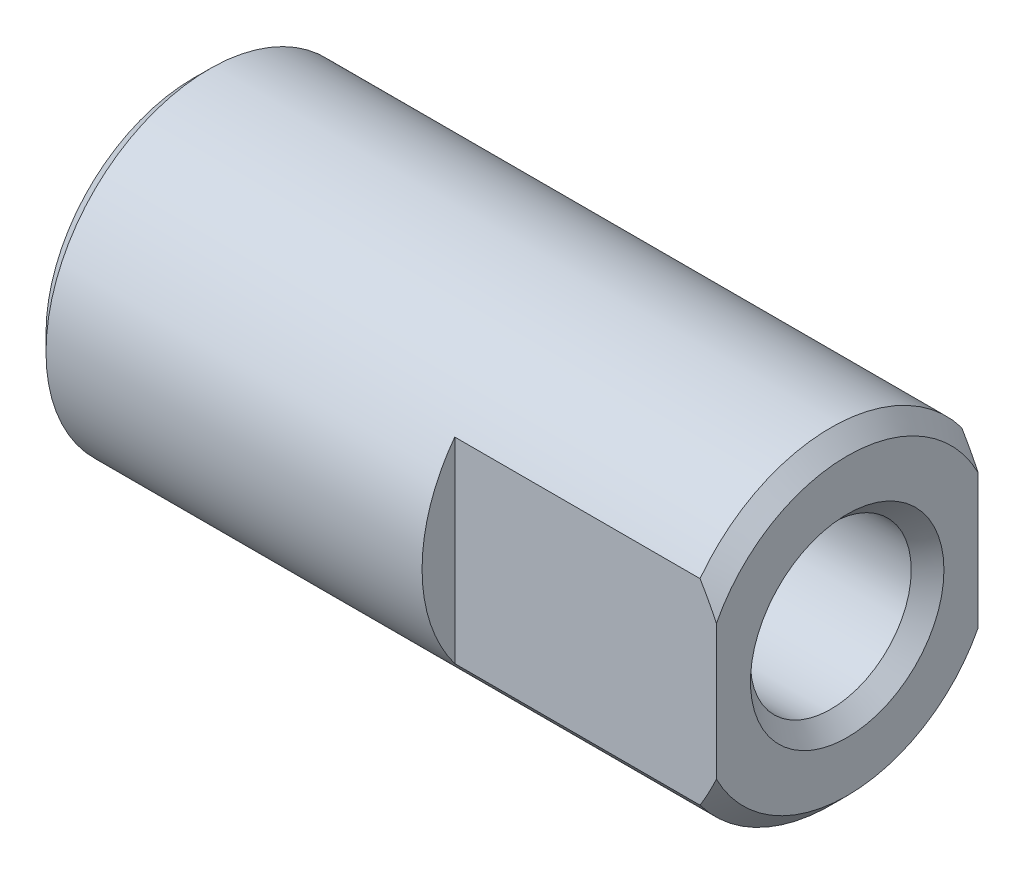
ISO-10303-21;
HEADER;
FILE_DESCRIPTION(('STEP AP214'),'2;1');
FILE_NAME('part.step','',(''),(''),'','','');
FILE_SCHEMA(('AUTOMOTIVE_DESIGN { 1 0 10303 214 1 1 1 1 }'));
ENDSEC;
DATA;
#1=APPLICATION_CONTEXT('core data for automotive mechanical design processes');
#2=APPLICATION_PROTOCOL_DEFINITION('international standard','automotive_design',2000,#1);
#3=PRODUCT_CONTEXT('',#1,'mechanical');
#4=PRODUCT('Part','Part','',(#3));
#5=PRODUCT_RELATED_PRODUCT_CATEGORY('part','',(#4));
#6=PRODUCT_DEFINITION_FORMATION('','',#4);
#7=PRODUCT_DEFINITION_CONTEXT('part definition',#1,'design');
#8=PRODUCT_DEFINITION('design','',#6,#7);
#9=PRODUCT_DEFINITION_SHAPE('','',#8);
#10=(LENGTH_UNIT() NAMED_UNIT(*) SI_UNIT(.MILLI.,.METRE.));
#11=(NAMED_UNIT(*) PLANE_ANGLE_UNIT() SI_UNIT($,.RADIAN.));
#12=(NAMED_UNIT(*) SI_UNIT($,.STERADIAN.) SOLID_ANGLE_UNIT());
#13=UNCERTAINTY_MEASURE_WITH_UNIT(LENGTH_MEASURE(1.E-05),#10,'distance_accuracy_value','');
#14=(GEOMETRIC_REPRESENTATION_CONTEXT(3) GLOBAL_UNCERTAINTY_ASSIGNED_CONTEXT((#13)) GLOBAL_UNIT_ASSIGNED_CONTEXT((#10,
#11,#12)) REPRESENTATION_CONTEXT('',''));
#15=CARTESIAN_POINT('',(0.,0.,0.));
#16=DIRECTION('',(0.,0.,1.));
#17=DIRECTION('',(1.,0.,0.));
#18=AXIS2_PLACEMENT_3D('',#15,#16,#17);
#19=CARTESIAN_POINT('',(20.,0.,0.));
#20=DIRECTION('',(-1.,0.,0.));
#21=DIRECTION('',(0.,0.,1.));
#22=AXIS2_PLACEMENT_3D('',#19,#20,#21);
#23=CYLINDRICAL_SURFACE('',#22,5.);
#24=CARTESIAN_POINT('',(0.499999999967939,0.,0.));
#25=DIRECTION('',(-1.,0.,0.));
#26=DIRECTION('',(0.,0.,1.));
#27=AXIS2_PLACEMENT_3D('',#24,#25,#26);
#28=CIRCLE('',#27,5.);
#29=CARTESIAN_POINT('',(0.499999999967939,0.,5.));
#30=VERTEX_POINT('',#29);
#31=EDGE_CURVE('E118',#30,#30,#28,.F.);
#32=ORIENTED_EDGE('',*,*,#31,.T.);
#33=EDGE_LOOP('',(#32));
#34=FACE_BOUND('',#33,.T.);
#35=DIRECTION('',(1.,0.,0.));
#36=VECTOR('',#35,1.);
#37=CARTESIAN_POINT('',(12.,3.,4.));
#38=LINE('',#37,#36);
#39=CARTESIAN_POINT('',(12.,3.,4.));
#40=VERTEX_POINT('',#39);
#41=CARTESIAN_POINT('',(19.5000000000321,3.,4.));
#42=VERTEX_POINT('',#41);
#43=EDGE_CURVE('E97',#40,#42,#38,.T.);
#44=ORIENTED_EDGE('',*,*,#43,.T.);
#45=CARTESIAN_POINT('',(19.5000000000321,0.,0.));
#46=DIRECTION('',(1.,0.,0.));
#47=DIRECTION('',(0.,0.,-1.));
#48=AXIS2_PLACEMENT_3D('',#45,#46,#47);
#49=CIRCLE('',#48,5.);
#50=CARTESIAN_POINT('',(19.5000000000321,3.,-4.));
#51=VERTEX_POINT('',#50);
#52=EDGE_CURVE('E124',#42,#51,#49,.F.);
#53=ORIENTED_EDGE('',*,*,#52,.T.);
#54=DIRECTION('',(1.,0.,0.));
#55=VECTOR('',#54,1.);
#56=CARTESIAN_POINT('',(12.,3.,-4.));
#57=LINE('',#56,#55);
#58=CARTESIAN_POINT('',(12.,3.,-4.));
#59=VERTEX_POINT('',#58);
#60=EDGE_CURVE('E113',#59,#51,#57,.T.);
#61=ORIENTED_EDGE('',*,*,#60,.F.);
#62=CARTESIAN_POINT('',(12.,0.,0.));
#63=DIRECTION('',(1.,0.,0.));
#64=DIRECTION('',(0.,0.,-1.));
#65=AXIS2_PLACEMENT_3D('',#62,#63,#64);
#66=CIRCLE('',#65,5.);
#67=CARTESIAN_POINT('',(12.,-3.,-4.));
#68=VERTEX_POINT('',#67);
#69=EDGE_CURVE('E108',#68,#59,#66,.T.);
#70=ORIENTED_EDGE('',*,*,#69,.F.);
#71=DIRECTION('',(1.,0.,0.));
#72=VECTOR('',#71,1.);
#73=CARTESIAN_POINT('',(12.,-3.,-4.));
#74=LINE('',#73,#72);
#75=CARTESIAN_POINT('',(19.5000000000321,-3.,-4.));
#76=VERTEX_POINT('',#75);
#77=EDGE_CURVE('E116',#68,#76,#74,.T.);
#78=ORIENTED_EDGE('',*,*,#77,.T.);
#79=CARTESIAN_POINT('',(19.5000000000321,0.,0.));
#80=DIRECTION('',(1.,0.,0.));
#81=DIRECTION('',(0.,0.,-1.));
#82=AXIS2_PLACEMENT_3D('',#79,#80,#81);
#83=CIRCLE('',#82,5.);
#84=CARTESIAN_POINT('',(19.5000000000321,-3.,4.));
#85=VERTEX_POINT('',#84);
#86=EDGE_CURVE('E102',#76,#85,#83,.F.);
#87=ORIENTED_EDGE('',*,*,#86,.T.);
#88=DIRECTION('',(1.,0.,0.));
#89=VECTOR('',#88,1.);
#90=CARTESIAN_POINT('',(12.,-3.,4.));
#91=LINE('',#90,#89);
#92=CARTESIAN_POINT('',(12.,-3.,4.));
#93=VERTEX_POINT('',#92);
#94=EDGE_CURVE('E96',#93,#85,#91,.T.);
#95=ORIENTED_EDGE('',*,*,#94,.F.);
#96=CARTESIAN_POINT('',(12.,0.,0.));
#97=DIRECTION('',(1.,0.,0.));
#98=DIRECTION('',(0.,0.,-1.));
#99=AXIS2_PLACEMENT_3D('',#96,#97,#98);
#100=CIRCLE('',#99,5.);
#101=EDGE_CURVE('E86',#40,#93,#100,.T.);
#102=ORIENTED_EDGE('',*,*,#101,.F.);
#103=EDGE_LOOP('',(#44,#53,#61,#70,#78,#87,#95,#102));
#104=FACE_BOUND('',#103,.T.);
#105=ADVANCED_FACE('F32',(#34,#104),#23,.T.);
#106=CARTESIAN_POINT('',(20.,5.,0.));
#107=DIRECTION('',(1.,0.,0.));
#108=DIRECTION('',(0.,0.,-1.));
#109=AXIS2_PLACEMENT_3D('',#106,#107,#108);
#110=PLANE('',#109);
#111=CARTESIAN_POINT('',(20.,0.,0.));
#112=DIRECTION('',(1.,0.,0.));
#113=DIRECTION('',(0.,0.,-1.));
#114=AXIS2_PLACEMENT_3D('',#111,#112,#113);
#115=CIRCLE('',#114,2.95849999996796);
#116=CARTESIAN_POINT('',(20.,0.,-2.95849999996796));
#117=VERTEX_POINT('',#116);
#118=EDGE_CURVE('E218',#117,#117,#115,.F.);
#119=ORIENTED_EDGE('',*,*,#118,.T.);
#120=EDGE_LOOP('',(#119));
#121=FACE_BOUND('',#120,.T.);
#122=DIRECTION('',(0.,-1.,0.));
#123=VECTOR('',#122,1.);
#124=CARTESIAN_POINT('',(20.,3.,-4.));
#125=LINE('',#124,#123);
#126=CARTESIAN_POINT('',(20.,2.0615528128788,-4.));
#127=VERTEX_POINT('',#126);
#128=CARTESIAN_POINT('',(20.,-2.0615528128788,-4.));
#129=VERTEX_POINT('',#128);
#130=EDGE_CURVE('E104',#127,#129,#125,.T.);
#131=ORIENTED_EDGE('',*,*,#130,.F.);
#132=CARTESIAN_POINT('',(20.,0.,0.));
#133=DIRECTION('',(1.,0.,0.));
#134=DIRECTION('',(0.,0.,-1.));
#135=AXIS2_PLACEMENT_3D('',#132,#133,#134);
#136=CIRCLE('',#135,4.50000000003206);
#137=CARTESIAN_POINT('',(20.,2.0615528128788,4.));
#138=VERTEX_POINT('',#137);
#139=EDGE_CURVE('E47',#127,#138,#136,.T.);
#140=ORIENTED_EDGE('',*,*,#139,.T.);
#141=DIRECTION('',(0.,1.,0.));
#142=VECTOR('',#141,1.);
#143=CARTESIAN_POINT('',(20.,-3.,4.));
#144=LINE('',#143,#142);
#145=CARTESIAN_POINT('',(20.,-2.0615528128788,4.));
#146=VERTEX_POINT('',#145);
#147=EDGE_CURVE('E93',#146,#138,#144,.T.);
#148=ORIENTED_EDGE('',*,*,#147,.F.);
#149=CARTESIAN_POINT('',(20.,0.,0.));
#150=DIRECTION('',(1.,0.,0.));
#151=DIRECTION('',(0.,0.,-1.));
#152=AXIS2_PLACEMENT_3D('',#149,#150,#151);
#153=CIRCLE('',#152,4.50000000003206);
#154=EDGE_CURVE('E219',#146,#129,#153,.T.);
#155=ORIENTED_EDGE('',*,*,#154,.T.);
#156=EDGE_LOOP('',(#131,#140,#148,#155));
#157=FACE_BOUND('',#156,.T.);
#158=ADVANCED_FACE('F155',(#121,#157),#110,.T.);
#159=CARTESIAN_POINT('',(0.,0.,0.));
#160=DIRECTION('',(-1.,0.,0.));
#161=DIRECTION('',(0.,0.,1.));
#162=AXIS2_PLACEMENT_3D('',#159,#160,#161);
#163=PLANE('',#162);
#164=CARTESIAN_POINT('',(0.,0.,0.));
#165=DIRECTION('',(-1.,0.,0.));
#166=DIRECTION('',(0.,0.,1.));
#167=AXIS2_PLACEMENT_3D('',#164,#165,#166);
#168=CIRCLE('',#167,2.95849999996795);
#169=CARTESIAN_POINT('',(0.,0.,2.95849999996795));
#170=VERTEX_POINT('',#169);
#171=EDGE_CURVE('E197',#170,#170,#168,.F.);
#172=ORIENTED_EDGE('',*,*,#171,.T.);
#173=EDGE_LOOP('',(#172));
#174=FACE_BOUND('',#173,.T.);
#175=CARTESIAN_POINT('',(0.,0.,0.));
#176=DIRECTION('',(-1.,0.,0.));
#177=DIRECTION('',(0.,0.,1.));
#178=AXIS2_PLACEMENT_3D('',#175,#176,#177);
#179=CIRCLE('',#178,4.50000000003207);
#180=CARTESIAN_POINT('',(0.,0.,4.50000000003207));
#181=VERTEX_POINT('',#180);
#182=EDGE_CURVE('E176',#181,#181,#179,.T.);
#183=ORIENTED_EDGE('',*,*,#182,.T.);
#184=EDGE_LOOP('',(#183));
#185=FACE_BOUND('',#184,.T.);
#186=ADVANCED_FACE('F149',(#174,#185),#163,.T.);
#187=CARTESIAN_POINT('',(12.,3.,-4.));
#188=DIRECTION('',(0.,0.,1.));
#189=DIRECTION('',(1.,0.,0.));
#190=AXIS2_PLACEMENT_3D('',#187,#188,#189);
#191=PLANE('',#190);
#192=ORIENTED_EDGE('',*,*,#60,.T.);
#193=CARTESIAN_POINT('',(19.5000000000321,3.,-4.));
#194=CARTESIAN_POINT('',(19.5456208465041,2.92395437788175,-4.));
#195=CARTESIAN_POINT('',(19.5904380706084,2.84741921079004,-4.));
#196=CARTESIAN_POINT('',(19.6781671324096,2.69334289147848,-4.));
#197=CARTESIAN_POINT('',(19.7210803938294,2.61580254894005,-4.));
#198=CARTESIAN_POINT('',(19.8047789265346,2.45956360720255,-4.));
#199=CARTESIAN_POINT('',(19.845563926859,2.38086486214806,-4.));
#200=CARTESIAN_POINT('',(19.9247002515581,2.22218014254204,-4.));
#201=CARTESIAN_POINT('',(19.9630496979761,2.14219323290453,-4.));
#202=CARTESIAN_POINT('',(20.,2.0615528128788,-4.));
#203=B_SPLINE_CURVE_WITH_KNOTS('',3,(#193,#194,#195,#196,#197,#198,#199,#200,#201,#202),
.UNSPECIFIED.,.F.,.F.,(4,2,2,2,4),(0.,0.266045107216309,0.531887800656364,0.797764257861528,
1.06384329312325),.UNSPECIFIED.);
#204=EDGE_CURVE('E134',#51,#127,#203,.T.);
#205=ORIENTED_EDGE('',*,*,#204,.T.);
#206=ORIENTED_EDGE('',*,*,#130,.T.);
#207=CARTESIAN_POINT('',(20.,-2.0615528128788,-4.));
#208=CARTESIAN_POINT('',(19.9630496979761,-2.14219323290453,-4.));
#209=CARTESIAN_POINT('',(19.9247002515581,-2.22218014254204,-4.));
#210=CARTESIAN_POINT('',(19.845563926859,-2.38086486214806,-4.));
#211=CARTESIAN_POINT('',(19.8047789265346,-2.45956360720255,-4.));
#212=CARTESIAN_POINT('',(19.7210803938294,-2.61580254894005,-4.));
#213=CARTESIAN_POINT('',(19.6781671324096,-2.69334289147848,-4.));
#214=CARTESIAN_POINT('',(19.5904380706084,-2.84741921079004,-4.));
#215=CARTESIAN_POINT('',(19.5456208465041,-2.92395437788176,-4.));
#216=CARTESIAN_POINT('',(19.5000000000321,-3.,-4.));
#217=B_SPLINE_CURVE_WITH_KNOTS('',3,(#207,#208,#209,#210,#211,#212,#213,#214,#215,#216),
.UNSPECIFIED.,.F.,.F.,(4,2,2,2,4),(0.,0.266079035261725,0.531955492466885,0.797798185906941,
1.06384329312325),.UNSPECIFIED.);
#218=EDGE_CURVE('E127',#129,#76,#217,.T.);
#219=ORIENTED_EDGE('',*,*,#218,.T.);
#220=ORIENTED_EDGE('',*,*,#77,.F.);
#221=DIRECTION('',(0.,-1.,0.));
#222=VECTOR('',#221,1.);
#223=CARTESIAN_POINT('',(12.,3.,-4.));
#224=LINE('',#223,#222);
#225=EDGE_CURVE('E110',#59,#68,#224,.T.);
#226=ORIENTED_EDGE('',*,*,#225,.F.);
#227=EDGE_LOOP('',(#192,#205,#206,#219,#220,#226));
#228=FACE_BOUND('',#227,.T.);
#229=ADVANCED_FACE('F143',(#228),#191,.F.);
#230=CARTESIAN_POINT('',(12.,0.,0.));
#231=DIRECTION('',(1.,0.,0.));
#232=DIRECTION('',(0.,0.,-1.));
#233=AXIS2_PLACEMENT_3D('',#230,#231,#232);
#234=PLANE('',#233);
#235=ORIENTED_EDGE('',*,*,#69,.T.);
#236=ORIENTED_EDGE('',*,*,#225,.T.);
#237=EDGE_LOOP('',(#235,#236));
#238=FACE_BOUND('',#237,.T.);
#239=ADVANCED_FACE('F148',(#238),#234,.T.);
#240=CARTESIAN_POINT('',(12.,-3.,4.));
#241=DIRECTION('',(0.,0.,-1.));
#242=DIRECTION('',(-1.,0.,0.));
#243=AXIS2_PLACEMENT_3D('',#240,#241,#242);
#244=PLANE('',#243);
#245=ORIENTED_EDGE('',*,*,#147,.T.);
#246=CARTESIAN_POINT('',(20.,2.0615528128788,4.));
#247=CARTESIAN_POINT('',(19.9630496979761,2.14219323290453,4.));
#248=CARTESIAN_POINT('',(19.9247002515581,2.22218014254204,4.));
#249=CARTESIAN_POINT('',(19.845563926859,2.38086486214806,4.));
#250=CARTESIAN_POINT('',(19.8047789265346,2.45956360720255,4.));
#251=CARTESIAN_POINT('',(19.7210803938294,2.61580254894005,4.));
#252=CARTESIAN_POINT('',(19.6781671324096,2.69334289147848,4.));
#253=CARTESIAN_POINT('',(19.5904380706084,2.84741921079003,4.));
#254=CARTESIAN_POINT('',(19.5456208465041,2.92395437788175,4.));
#255=CARTESIAN_POINT('',(19.5000000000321,3.,4.));
#256=B_SPLINE_CURVE_WITH_KNOTS('',3,(#246,#247,#248,#249,#250,#251,#252,#253,#254,#255),
.UNSPECIFIED.,.F.,.F.,(4,2,2,2,4),(0.,0.26607903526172,0.531955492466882,0.797798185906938,
1.06384329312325),.UNSPECIFIED.);
#257=EDGE_CURVE('E170',#138,#42,#256,.T.);
#258=ORIENTED_EDGE('',*,*,#257,.T.);
#259=ORIENTED_EDGE('',*,*,#43,.F.);
#260=DIRECTION('',(0.,1.,0.));
#261=VECTOR('',#260,1.);
#262=CARTESIAN_POINT('',(12.,-3.,4.));
#263=LINE('',#262,#261);
#264=EDGE_CURVE('E89',#93,#40,#263,.T.);
#265=ORIENTED_EDGE('',*,*,#264,.F.);
#266=ORIENTED_EDGE('',*,*,#94,.T.);
#267=CARTESIAN_POINT('',(19.5000000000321,-3.,4.));
#268=CARTESIAN_POINT('',(19.5456208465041,-2.92395437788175,4.));
#269=CARTESIAN_POINT('',(19.5904380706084,-2.84741921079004,4.));
#270=CARTESIAN_POINT('',(19.6781671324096,-2.69334289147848,4.));
#271=CARTESIAN_POINT('',(19.7210803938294,-2.61580254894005,4.));
#272=CARTESIAN_POINT('',(19.8047789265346,-2.45956360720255,4.));
#273=CARTESIAN_POINT('',(19.845563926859,-2.38086486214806,4.));
#274=CARTESIAN_POINT('',(19.9247002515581,-2.22218014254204,4.));
#275=CARTESIAN_POINT('',(19.9630496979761,-2.14219323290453,4.));
#276=CARTESIAN_POINT('',(20.,-2.0615528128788,4.));
#277=B_SPLINE_CURVE_WITH_KNOTS('',3,(#267,#268,#269,#270,#271,#272,#273,#274,#275,#276),
.UNSPECIFIED.,.F.,.F.,(4,2,2,2,4),(0.,0.266045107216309,0.531887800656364,0.797764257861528,
1.06384329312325),.UNSPECIFIED.);
#278=EDGE_CURVE('E54',#85,#146,#277,.T.);
#279=ORIENTED_EDGE('',*,*,#278,.T.);
#280=EDGE_LOOP('',(#245,#258,#259,#265,#266,#279));
#281=FACE_BOUND('',#280,.T.);
#282=ADVANCED_FACE('F95',(#281),#244,.F.);
#283=CARTESIAN_POINT('',(12.,0.,0.));
#284=DIRECTION('',(1.,0.,0.));
#285=DIRECTION('',(0.,0.,-1.));
#286=AXIS2_PLACEMENT_3D('',#283,#284,#285);
#287=PLANE('',#286);
#288=ORIENTED_EDGE('',*,*,#101,.T.);
#289=ORIENTED_EDGE('',*,*,#264,.T.);
#290=EDGE_LOOP('',(#288,#289));
#291=FACE_BOUND('',#290,.T.);
#292=ADVANCED_FACE('F88',(#291),#287,.T.);
#293=CARTESIAN_POINT('',(20.,0.,0.));
#294=DIRECTION('',(1.,0.,0.));
#295=DIRECTION('',(0.,0.,-1.));
#296=AXIS2_PLACEMENT_3D('',#293,#294,#295);
#297=CYLINDRICAL_SURFACE('',#296,2.45850000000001);
#298=CARTESIAN_POINT('',(0.499999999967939,0.,0.));
#299=DIRECTION('',(-1.,0.,0.));
#300=DIRECTION('',(0.,0.,1.));
#301=AXIS2_PLACEMENT_3D('',#298,#299,#300);
#302=CIRCLE('',#301,2.45850000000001);
#303=CARTESIAN_POINT('',(0.499999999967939,0.,2.45850000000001));
#304=VERTEX_POINT('',#303);
#305=EDGE_CURVE('E11',#304,#304,#302,.T.);
#306=ORIENTED_EDGE('',*,*,#305,.T.);
#307=EDGE_LOOP('',(#306));
#308=FACE_BOUND('',#307,.T.);
#309=CARTESIAN_POINT('',(19.5000000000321,0.,0.));
#310=DIRECTION('',(1.,0.,0.));
#311=DIRECTION('',(0.,0.,-1.));
#312=AXIS2_PLACEMENT_3D('',#309,#310,#311);
#313=CIRCLE('',#312,2.45850000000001);
#314=CARTESIAN_POINT('',(19.5000000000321,0.,-2.45850000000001));
#315=VERTEX_POINT('',#314);
#316=EDGE_CURVE('E40',#315,#315,#313,.T.);
#317=ORIENTED_EDGE('',*,*,#316,.T.);
#318=EDGE_LOOP('',(#317));
#319=FACE_BOUND('',#318,.T.);
#320=ADVANCED_FACE('F166',(#308,#319),#297,.F.);
#321=CARTESIAN_POINT('',(19.5000000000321,0.,0.));
#322=DIRECTION('',(-1.,0.,0.));
#323=DIRECTION('',(0.,0.,1.));
#324=AXIS2_PLACEMENT_3D('',#321,#322,#323);
#325=CONICAL_SURFACE('',#324,5.,0.785398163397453);
#326=ORIENTED_EDGE('',*,*,#257,.F.);
#327=ORIENTED_EDGE('',*,*,#139,.F.);
#328=ORIENTED_EDGE('',*,*,#204,.F.);
#329=ORIENTED_EDGE('',*,*,#52,.F.);
#330=EDGE_LOOP('',(#326,#327,#328,#329));
#331=FACE_BOUND('',#330,.T.);
#332=ADVANCED_FACE('F162',(#331),#325,.T.);
#333=CARTESIAN_POINT('',(0.,0.,0.));
#334=DIRECTION('',(-1.,0.,0.));
#335=DIRECTION('',(0.,0.,1.));
#336=AXIS2_PLACEMENT_3D('',#333,#334,#335);
#337=CONICAL_SURFACE('',#336,2.95849999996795,0.785398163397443);
#338=ORIENTED_EDGE('',*,*,#305,.F.);
#339=EDGE_LOOP('',(#338));
#340=FACE_BOUND('',#339,.T.);
#341=ORIENTED_EDGE('',*,*,#171,.F.);
#342=EDGE_LOOP('',(#341));
#343=FACE_BOUND('',#342,.T.);
#344=ADVANCED_FACE('F165',(#340,#343),#337,.F.);
#345=CARTESIAN_POINT('',(19.5000000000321,0.,0.));
#346=DIRECTION('',(-1.,0.,0.));
#347=DIRECTION('',(0.,0.,1.));
#348=AXIS2_PLACEMENT_3D('',#345,#346,#347);
#349=CONICAL_SURFACE('',#348,5.,0.785398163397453);
#350=ORIENTED_EDGE('',*,*,#218,.F.);
#351=ORIENTED_EDGE('',*,*,#154,.F.);
#352=ORIENTED_EDGE('',*,*,#278,.F.);
#353=ORIENTED_EDGE('',*,*,#86,.F.);
#354=EDGE_LOOP('',(#350,#351,#352,#353));
#355=FACE_BOUND('',#354,.T.);
#356=ADVANCED_FACE('F140',(#355),#349,.T.);
#357=CARTESIAN_POINT('',(19.5000000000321,0.,0.));
#358=DIRECTION('',(1.,0.,0.));
#359=DIRECTION('',(0.,0.,-1.));
#360=AXIS2_PLACEMENT_3D('',#357,#358,#359);
#361=CONICAL_SURFACE('',#360,2.45850000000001,0.78539816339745);
#362=ORIENTED_EDGE('',*,*,#118,.F.);
#363=EDGE_LOOP('',(#362));
#364=FACE_BOUND('',#363,.T.);
#365=ORIENTED_EDGE('',*,*,#316,.F.);
#366=EDGE_LOOP('',(#365));
#367=FACE_BOUND('',#366,.T.);
#368=ADVANCED_FACE('F205',(#364,#367),#361,.F.);
#369=CARTESIAN_POINT('',(0.,0.,0.));
#370=DIRECTION('',(1.,0.,0.));
#371=DIRECTION('',(0.,0.,-1.));
#372=AXIS2_PLACEMENT_3D('',#369,#370,#371);
#373=CONICAL_SURFACE('',#372,4.50000000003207,0.785398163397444);
#374=ORIENTED_EDGE('',*,*,#31,.F.);
#375=EDGE_LOOP('',(#374));
#376=FACE_BOUND('',#375,.T.);
#377=ORIENTED_EDGE('',*,*,#182,.F.);
#378=EDGE_LOOP('',(#377));
#379=FACE_BOUND('',#378,.T.);
#380=ADVANCED_FACE('F34',(#376,#379),#373,.T.);
#381=CLOSED_SHELL('',(#105,#158,#186,#229,#239,#282,#292,#320,#332,#344,#356,#368,#380));
#382=MANIFOLD_SOLID_BREP('B2',#381);
#383=ADVANCED_BREP_SHAPE_REPRESENTATION('',(#18,#382),#14);
#384=SHAPE_DEFINITION_REPRESENTATION(#9,#383);
ENDSEC;
END-ISO-10303-21;
